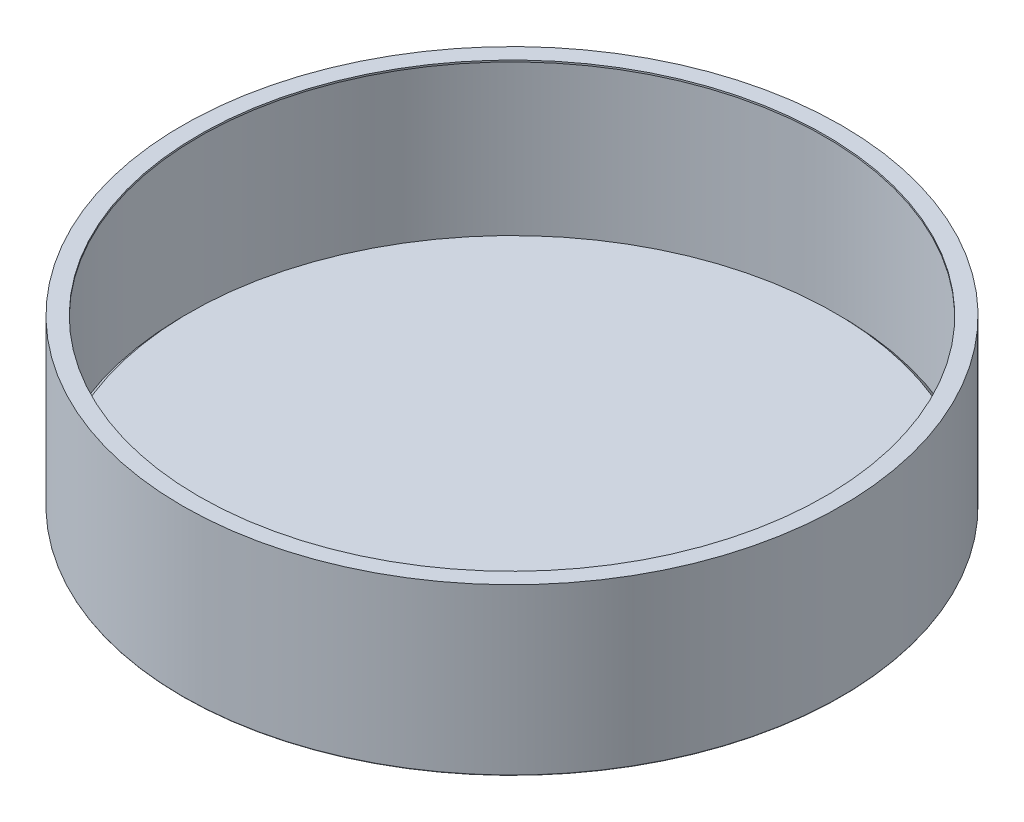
ISO-10303-21;
HEADER;
FILE_DESCRIPTION(('STEP AP214'),'2;1');
FILE_NAME('part.step','',(''),(''),'','','');
FILE_SCHEMA(('AUTOMOTIVE_DESIGN { 1 0 10303 214 1 1 1 1 }'));
ENDSEC;
DATA;
#1=APPLICATION_CONTEXT('core data for automotive mechanical design processes');
#2=APPLICATION_PROTOCOL_DEFINITION('international standard','automotive_design',2000,#1);
#3=PRODUCT_CONTEXT('',#1,'mechanical');
#4=PRODUCT('Part','Part','',(#3));
#5=PRODUCT_RELATED_PRODUCT_CATEGORY('part','',(#4));
#6=PRODUCT_DEFINITION_FORMATION('','',#4);
#7=PRODUCT_DEFINITION_CONTEXT('part definition',#1,'design');
#8=PRODUCT_DEFINITION('design','',#6,#7);
#9=PRODUCT_DEFINITION_SHAPE('','',#8);
#10=(LENGTH_UNIT() NAMED_UNIT(*) SI_UNIT(.MILLI.,.METRE.));
#11=(NAMED_UNIT(*) PLANE_ANGLE_UNIT() SI_UNIT($,.RADIAN.));
#12=(NAMED_UNIT(*) SI_UNIT($,.STERADIAN.) SOLID_ANGLE_UNIT());
#13=UNCERTAINTY_MEASURE_WITH_UNIT(LENGTH_MEASURE(1.E-05),#10,'distance_accuracy_value','');
#14=(GEOMETRIC_REPRESENTATION_CONTEXT(3) GLOBAL_UNCERTAINTY_ASSIGNED_CONTEXT((#13)) GLOBAL_UNIT_ASSIGNED_CONTEXT((#10,
#11,#12)) REPRESENTATION_CONTEXT('',''));
#15=CARTESIAN_POINT('',(0.,0.,0.));
#16=DIRECTION('',(0.,0.,1.));
#17=DIRECTION('',(1.,0.,0.));
#18=AXIS2_PLACEMENT_3D('',#15,#16,#17);
#19=CARTESIAN_POINT('',(0.,0.,0.));
#20=DIRECTION('',(0.,-1.,0.));
#21=DIRECTION('',(0.,0.,-1.));
#22=AXIS2_PLACEMENT_3D('',#19,#20,#21);
#23=PLANE('',#22);
#24=CARTESIAN_POINT('',(0.0938221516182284,0.,100.093822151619));
#25=DIRECTION('',(0.,-1.,0.));
#26=DIRECTION('',(0.,0.,-1.));
#27=AXIS2_PLACEMENT_3D('',#24,#25,#26);
#28=CIRCLE('',#27,6.00000000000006);
#29=CARTESIAN_POINT('',(0.0938221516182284,0.,94.0938221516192));
#30=VERTEX_POINT('',#29);
#31=EDGE_CURVE('E10',#30,#30,#28,.T.);
#32=ORIENTED_EDGE('',*,*,#31,.F.);
#33=EDGE_LOOP('',(#32));
#34=FACE_BOUND('',#33,.T.);
#35=CARTESIAN_POINT('',(100.187644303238,0.,0.));
#36=DIRECTION('',(0.,-1.,0.));
#37=DIRECTION('',(0.,0.,-1.));
#38=AXIS2_PLACEMENT_3D('',#35,#36,#37);
#39=CIRCLE('',#38,6.00000000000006);
#40=CARTESIAN_POINT('',(100.187644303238,0.,-6.00000000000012));
#41=VERTEX_POINT('',#40);
#42=EDGE_CURVE('E44',#41,#41,#39,.T.);
#43=ORIENTED_EDGE('',*,*,#42,.F.);
#44=EDGE_LOOP('',(#43));
#45=FACE_BOUND('',#44,.T.);
#46=CARTESIAN_POINT('',(0.0938221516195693,0.,-100.093822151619));
#47=DIRECTION('',(0.,-1.,0.));
#48=DIRECTION('',(0.,0.,-1.));
#49=AXIS2_PLACEMENT_3D('',#46,#47,#48);
#50=CIRCLE('',#49,6.00000000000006);
#51=CARTESIAN_POINT('',(0.0938221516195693,0.,-106.093822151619));
#52=VERTEX_POINT('',#51);
#53=EDGE_CURVE('E49',#52,#52,#50,.T.);
#54=ORIENTED_EDGE('',*,*,#53,.F.);
#55=EDGE_LOOP('',(#54));
#56=FACE_BOUND('',#55,.T.);
#57=CARTESIAN_POINT('',(-100.,0.,0.));
#58=DIRECTION('',(0.,-1.,0.));
#59=DIRECTION('',(0.,0.,-1.));
#60=AXIS2_PLACEMENT_3D('',#57,#58,#59);
#61=CIRCLE('',#60,6.00000000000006);
#62=CARTESIAN_POINT('',(-100.,0.,-6.00000000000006));
#63=VERTEX_POINT('',#62);
#64=EDGE_CURVE('E54',#63,#63,#61,.T.);
#65=ORIENTED_EDGE('',*,*,#64,.F.);
#66=EDGE_LOOP('',(#65));
#67=FACE_BOUND('',#66,.T.);
#68=CARTESIAN_POINT('',(0.,0.,0.));
#69=DIRECTION('',(0.,1.,0.));
#70=DIRECTION('',(0.,0.,1.));
#71=AXIS2_PLACEMENT_3D('',#68,#69,#70);
#72=CIRCLE('',#71,195.975685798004);
#73=CARTESIAN_POINT('',(0.,0.,195.975685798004));
#74=VERTEX_POINT('',#73);
#75=EDGE_CURVE('E60',#74,#74,#72,.T.);
#76=ORIENTED_EDGE('',*,*,#75,.F.);
#77=EDGE_LOOP('',(#76));
#78=FACE_BOUND('',#77,.T.);
#79=ADVANCED_FACE('F37',(#34,#45,#56,#67,#78),#23,.T.);
#80=CARTESIAN_POINT('',(0.,-2.8586098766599,0.));
#81=DIRECTION('',(0.,-1.,0.));
#82=DIRECTION('',(0.,0.,-1.));
#83=AXIS2_PLACEMENT_3D('',#80,#81,#82);
#84=CONICAL_SURFACE('',#83,198.900626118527,0.796866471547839);
#85=ORIENTED_EDGE('',*,*,#75,.T.);
#86=EDGE_LOOP('',(#85));
#87=FACE_BOUND('',#86,.T.);
#88=CARTESIAN_POINT('',(0.,-2.8586098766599,0.));
#89=DIRECTION('',(0.,1.,0.));
#90=DIRECTION('',(0.,0.,1.));
#91=AXIS2_PLACEMENT_3D('',#88,#89,#90);
#92=CIRCLE('',#91,198.900626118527);
#93=CARTESIAN_POINT('',(0.,-2.8586098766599,198.900626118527));
#94=VERTEX_POINT('',#93);
#95=EDGE_CURVE('E64',#94,#94,#92,.T.);
#96=ORIENTED_EDGE('',*,*,#95,.F.);
#97=EDGE_LOOP('',(#96));
#98=FACE_BOUND('',#97,.T.);
#99=ADVANCED_FACE('F136',(#87,#98),#84,.F.);
#100=CARTESIAN_POINT('',(0.,-2.50102516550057,0.));
#101=DIRECTION('',(0.,1.,0.));
#102=DIRECTION('',(0.,0.,1.));
#103=AXIS2_PLACEMENT_3D('',#100,#101,#102);
#104=TOROIDAL_SURFACE('',#103,199.250101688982,0.500000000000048);
#105=ORIENTED_EDGE('',*,*,#95,.T.);
#106=EDGE_LOOP('',(#105));
#107=FACE_BOUND('',#106,.T.);
#108=CARTESIAN_POINT('',(0.,-3.00102516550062,0.));
#109=DIRECTION('',(0.,1.,0.));
#110=DIRECTION('',(0.,0.,1.));
#111=AXIS2_PLACEMENT_3D('',#108,#109,#110);
#112=CIRCLE('',#111,199.250101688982);
#113=CARTESIAN_POINT('',(0.,-3.00102516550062,199.250101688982));
#114=VERTEX_POINT('',#113);
#115=EDGE_CURVE('E68',#114,#114,#112,.T.);
#116=ORIENTED_EDGE('',*,*,#115,.F.);
#117=EDGE_LOOP('',(#116));
#118=FACE_BOUND('',#117,.T.);
#119=ADVANCED_FACE('F141',(#107,#118),#104,.T.);
#120=CARTESIAN_POINT('',(-199.530777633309,-3.00102516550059,0.));
#121=DIRECTION('',(0.,-1.,0.));
#122=DIRECTION('',(0.,0.,-1.));
#123=AXIS2_PLACEMENT_3D('',#120,#121,#122);
#124=PLANE('',#123);
#125=ORIENTED_EDGE('',*,*,#115,.T.);
#126=EDGE_LOOP('',(#125));
#127=FACE_BOUND('',#126,.T.);
#128=CARTESIAN_POINT('',(0.,-3.00102516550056,0.));
#129=DIRECTION('',(0.,1.,0.));
#130=DIRECTION('',(0.,0.,1.));
#131=AXIS2_PLACEMENT_3D('',#128,#129,#130);
#132=CIRCLE('',#131,199.530777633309);
#133=CARTESIAN_POINT('',(0.,-3.00102516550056,199.530777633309));
#134=VERTEX_POINT('',#133);
#135=EDGE_CURVE('E72',#134,#134,#132,.T.);
#136=ORIENTED_EDGE('',*,*,#135,.F.);
#137=EDGE_LOOP('',(#136));
#138=FACE_BOUND('',#137,.T.);
#139=ADVANCED_FACE('F155',(#127,#138),#124,.T.);
#140=CARTESIAN_POINT('',(0.,-2.50102516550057,0.));
#141=DIRECTION('',(0.,1.,0.));
#142=DIRECTION('',(0.,0.,1.));
#143=AXIS2_PLACEMENT_3D('',#140,#141,#142);
#144=TOROIDAL_SURFACE('',#143,199.530777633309,0.5);
#145=ORIENTED_EDGE('',*,*,#135,.T.);
#146=EDGE_LOOP('',(#145));
#147=FACE_BOUND('',#146,.T.);
#148=CARTESIAN_POINT('',(0.,-2.50102516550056,0.));
#149=DIRECTION('',(0.,1.,0.));
#150=DIRECTION('',(0.,0.,1.));
#151=AXIS2_PLACEMENT_3D('',#148,#149,#150);
#152=CIRCLE('',#151,200.030777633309);
#153=CARTESIAN_POINT('',(0.,-2.50102516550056,200.030777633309));
#154=VERTEX_POINT('',#153);
#155=EDGE_CURVE('E76',#154,#154,#152,.T.);
#156=ORIENTED_EDGE('',*,*,#155,.F.);
#157=EDGE_LOOP('',(#156));
#158=FACE_BOUND('',#157,.T.);
#159=ADVANCED_FACE('F161',(#147,#158),#144,.T.);
#160=CARTESIAN_POINT('',(0.,96.1468871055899,0.));
#161=DIRECTION('',(0.,1.,0.));
#162=DIRECTION('',(0.,0.,1.));
#163=AXIS2_PLACEMENT_3D('',#160,#161,#162);
#164=CYLINDRICAL_SURFACE('',#163,200.030777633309);
#165=ORIENTED_EDGE('',*,*,#155,.T.);
#166=EDGE_LOOP('',(#165));
#167=FACE_BOUND('',#166,.T.);
#168=CARTESIAN_POINT('',(0.,97.4734323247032,0.));
#169=DIRECTION('',(0.,1.,0.));
#170=DIRECTION('',(0.,0.,1.));
#171=AXIS2_PLACEMENT_3D('',#168,#169,#170);
#172=CIRCLE('',#171,200.030777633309);
#173=CARTESIAN_POINT('',(0.,97.4734323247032,200.030777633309));
#174=VERTEX_POINT('',#173);
#175=EDGE_CURVE('E80',#174,#174,#172,.T.);
#176=ORIENTED_EDGE('',*,*,#175,.F.);
#177=EDGE_LOOP('',(#176));
#178=FACE_BOUND('',#177,.T.);
#179=ADVANCED_FACE('F167',(#167,#178),#164,.T.);
#180=CARTESIAN_POINT('',(-190.030777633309,97.4734323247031,0.));
#181=DIRECTION('',(0.,1.,0.));
#182=DIRECTION('',(0.,0.,1.));
#183=AXIS2_PLACEMENT_3D('',#180,#181,#182);
#184=PLANE('',#183);
#185=ORIENTED_EDGE('',*,*,#175,.T.);
#186=EDGE_LOOP('',(#185));
#187=FACE_BOUND('',#186,.T.);
#188=CARTESIAN_POINT('',(0.,97.473432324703,0.));
#189=DIRECTION('',(0.,1.,0.));
#190=DIRECTION('',(0.,0.,1.));
#191=AXIS2_PLACEMENT_3D('',#188,#189,#190);
#192=CIRCLE('',#191,190.030777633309);
#193=CARTESIAN_POINT('',(0.,97.473432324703,190.030777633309));
#194=VERTEX_POINT('',#193);
#195=EDGE_CURVE('E84',#194,#194,#192,.T.);
#196=ORIENTED_EDGE('',*,*,#195,.F.);
#197=EDGE_LOOP('',(#196));
#198=FACE_BOUND('',#197,.T.);
#199=ADVANCED_FACE('F173',(#187,#198),#184,.T.);
#200=CARTESIAN_POINT('',(0.,96.1468871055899,0.));
#201=DIRECTION('',(0.,1.,0.));
#202=DIRECTION('',(0.,0.,1.));
#203=AXIS2_PLACEMENT_3D('',#200,#201,#202);
#204=CYLINDRICAL_SURFACE('',#203,190.030777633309);
#205=ORIENTED_EDGE('',*,*,#195,.T.);
#206=EDGE_LOOP('',(#205));
#207=FACE_BOUND('',#206,.T.);
#208=CARTESIAN_POINT('',(0.,96.4734323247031,0.));
#209=DIRECTION('',(0.,1.,0.));
#210=DIRECTION('',(0.,0.,1.));
#211=AXIS2_PLACEMENT_3D('',#208,#209,#210);
#212=CIRCLE('',#211,190.030777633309);
#213=CARTESIAN_POINT('',(0.,96.4734323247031,190.030777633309));
#214=VERTEX_POINT('',#213);
#215=EDGE_CURVE('E88',#214,#214,#212,.T.);
#216=ORIENTED_EDGE('',*,*,#215,.F.);
#217=EDGE_LOOP('',(#216));
#218=FACE_BOUND('',#217,.T.);
#219=ADVANCED_FACE('F179',(#207,#218),#204,.F.);
#220=CARTESIAN_POINT('',(-198.986716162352,96.4734323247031,0.));
#221=DIRECTION('',(0.,-1.,0.));
#222=DIRECTION('',(0.,0.,-1.));
#223=AXIS2_PLACEMENT_3D('',#220,#221,#222);
#224=PLANE('',#223);
#225=ORIENTED_EDGE('',*,*,#215,.T.);
#226=EDGE_LOOP('',(#225));
#227=FACE_BOUND('',#226,.T.);
#228=CARTESIAN_POINT('',(0.,96.4734323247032,0.));
#229=DIRECTION('',(0.,1.,0.));
#230=DIRECTION('',(0.,0.,1.));
#231=AXIS2_PLACEMENT_3D('',#228,#229,#230);
#232=CIRCLE('',#231,198.986716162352);
#233=CARTESIAN_POINT('',(0.,96.4734323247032,198.986716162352));
#234=VERTEX_POINT('',#233);
#235=EDGE_CURVE('E92',#234,#234,#232,.T.);
#236=ORIENTED_EDGE('',*,*,#235,.F.);
#237=EDGE_LOOP('',(#236));
#238=FACE_BOUND('',#237,.T.);
#239=ADVANCED_FACE('F185',(#227,#238),#224,.T.);
#240=CARTESIAN_POINT('',(0.,96.1468871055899,0.));
#241=DIRECTION('',(0.,1.,0.));
#242=DIRECTION('',(0.,0.,1.));
#243=AXIS2_PLACEMENT_3D('',#240,#241,#242);
#244=CYLINDRICAL_SURFACE('',#243,198.986716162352);
#245=ORIENTED_EDGE('',*,*,#235,.T.);
#246=EDGE_LOOP('',(#245));
#247=FACE_BOUND('',#246,.T.);
#248=CARTESIAN_POINT('',(0.,-2.01882482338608,0.));
#249=DIRECTION('',(0.,1.,0.));
#250=DIRECTION('',(0.,0.,1.));
#251=AXIS2_PLACEMENT_3D('',#248,#249,#250);
#252=CIRCLE('',#251,198.986716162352);
#253=CARTESIAN_POINT('',(0.,-2.01882482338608,198.986716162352));
#254=VERTEX_POINT('',#253);
#255=EDGE_CURVE('E96',#254,#254,#252,.T.);
#256=ORIENTED_EDGE('',*,*,#255,.F.);
#257=EDGE_LOOP('',(#256));
#258=FACE_BOUND('',#257,.T.);
#259=ADVANCED_FACE('F191',(#247,#258),#244,.F.);
#260=CARTESIAN_POINT('',(0.,1.00000000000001,0.));
#261=DIRECTION('',(0.,-1.,0.));
#262=DIRECTION('',(0.,0.,-1.));
#263=AXIS2_PLACEMENT_3D('',#260,#261,#262);
#264=CONICAL_SURFACE('',#263,195.975685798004,0.784105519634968);
#265=ORIENTED_EDGE('',*,*,#255,.T.);
#266=EDGE_LOOP('',(#265));
#267=FACE_BOUND('',#266,.T.);
#268=CARTESIAN_POINT('',(0.,1.00000000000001,0.));
#269=DIRECTION('',(0.,1.,0.));
#270=DIRECTION('',(0.,0.,1.));
#271=AXIS2_PLACEMENT_3D('',#268,#269,#270);
#272=CIRCLE('',#271,195.975685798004);
#273=CARTESIAN_POINT('',(0.,1.00000000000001,195.975685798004));
#274=VERTEX_POINT('',#273);
#275=EDGE_CURVE('E100',#274,#274,#272,.T.);
#276=ORIENTED_EDGE('',*,*,#275,.F.);
#277=EDGE_LOOP('',(#276));
#278=FACE_BOUND('',#277,.T.);
#279=ADVANCED_FACE('F197',(#267,#278),#264,.T.);
#280=CARTESIAN_POINT('',(-195.975685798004,1.00000000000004,0.));
#281=DIRECTION('',(0.,1.,0.));
#282=DIRECTION('',(0.,0.,1.));
#283=AXIS2_PLACEMENT_3D('',#280,#281,#282);
#284=PLANE('',#283);
#285=ORIENTED_EDGE('',*,*,#275,.T.);
#286=EDGE_LOOP('',(#285));
#287=FACE_BOUND('',#286,.T.);
#288=ADVANCED_FACE('F203',(#287),#284,.T.);
#289=CARTESIAN_POINT('',(-100.,-2.,0.));
#290=DIRECTION('',(0.,-1.,0.));
#291=DIRECTION('',(0.,0.,-1.));
#292=AXIS2_PLACEMENT_3D('',#289,#290,#291);
#293=PLANE('',#292);
#294=CARTESIAN_POINT('',(-100.,-2.,0.));
#295=DIRECTION('',(0.,1.,0.));
#296=DIRECTION('',(0.,0.,1.));
#297=AXIS2_PLACEMENT_3D('',#294,#295,#296);
#298=CIRCLE('',#297,3.);
#299=CARTESIAN_POINT('',(-100.,-2.,3.));
#300=VERTEX_POINT('',#299);
#301=EDGE_CURVE('E104',#300,#300,#298,.T.);
#302=ORIENTED_EDGE('',*,*,#301,.F.);
#303=EDGE_LOOP('',(#302));
#304=FACE_BOUND('',#303,.T.);
#305=ADVANCED_FACE('F208',(#304),#293,.T.);
#306=CARTESIAN_POINT('',(-100.,0.,0.));
#307=DIRECTION('',(0.,1.,0.));
#308=DIRECTION('',(0.,0.,1.));
#309=AXIS2_PLACEMENT_3D('',#306,#307,#308);
#310=CONICAL_SURFACE('',#309,6.00000000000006,0.982793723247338);
#311=ORIENTED_EDGE('',*,*,#301,.T.);
#312=EDGE_LOOP('',(#311));
#313=FACE_BOUND('',#312,.T.);
#314=ORIENTED_EDGE('',*,*,#64,.T.);
#315=EDGE_LOOP('',(#314));
#316=FACE_BOUND('',#315,.T.);
#317=ADVANCED_FACE('F213',(#313,#316),#310,.T.);
#318=CARTESIAN_POINT('',(0.0938221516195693,-2.,-100.093822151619));
#319=DIRECTION('',(0.,-1.,0.));
#320=DIRECTION('',(1.,0.,0.));
#321=AXIS2_PLACEMENT_3D('',#318,#319,#320);
#322=PLANE('',#321);
#323=CARTESIAN_POINT('',(0.0938221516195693,-2.,-100.093822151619));
#324=DIRECTION('',(0.,1.,0.));
#325=DIRECTION('',(-1.,0.,0.));
#326=AXIS2_PLACEMENT_3D('',#323,#324,#325);
#327=CIRCLE('',#326,3.);
#328=CARTESIAN_POINT('',(-2.90617784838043,-2.,-100.093822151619));
#329=VERTEX_POINT('',#328);
#330=EDGE_CURVE('E108',#329,#329,#327,.T.);
#331=ORIENTED_EDGE('',*,*,#330,.F.);
#332=EDGE_LOOP('',(#331));
#333=FACE_BOUND('',#332,.T.);
#334=ADVANCED_FACE('F219',(#333),#322,.T.);
#335=CARTESIAN_POINT('',(0.0938221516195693,0.,-100.093822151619));
#336=DIRECTION('',(0.,1.,0.));
#337=DIRECTION('',(-1.,0.,0.));
#338=AXIS2_PLACEMENT_3D('',#335,#336,#337);
#339=CONICAL_SURFACE('',#338,6.00000000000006,0.982793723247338);
#340=ORIENTED_EDGE('',*,*,#330,.T.);
#341=EDGE_LOOP('',(#340));
#342=FACE_BOUND('',#341,.T.);
#343=ORIENTED_EDGE('',*,*,#53,.T.);
#344=EDGE_LOOP('',(#343));
#345=FACE_BOUND('',#344,.T.);
#346=ADVANCED_FACE('F223',(#342,#345),#339,.T.);
#347=CARTESIAN_POINT('',(100.187644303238,-2.,0.));
#348=DIRECTION('',(0.,-1.,0.));
#349=DIRECTION('',(0.,0.,1.));
#350=AXIS2_PLACEMENT_3D('',#347,#348,#349);
#351=PLANE('',#350);
#352=CARTESIAN_POINT('',(100.187644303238,-2.,0.));
#353=DIRECTION('',(0.,1.,0.));
#354=DIRECTION('',(0.,0.,-1.));
#355=AXIS2_PLACEMENT_3D('',#352,#353,#354);
#356=CIRCLE('',#355,3.);
#357=CARTESIAN_POINT('',(100.187644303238,-2.,-3.00000000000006));
#358=VERTEX_POINT('',#357);
#359=EDGE_CURVE('E112',#358,#358,#356,.T.);
#360=ORIENTED_EDGE('',*,*,#359,.F.);
#361=EDGE_LOOP('',(#360));
#362=FACE_BOUND('',#361,.T.);
#363=ADVANCED_FACE('F132',(#362),#351,.T.);
#364=CARTESIAN_POINT('',(100.187644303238,0.,0.));
#365=DIRECTION('',(0.,1.,0.));
#366=DIRECTION('',(0.,0.,-1.));
#367=AXIS2_PLACEMENT_3D('',#364,#365,#366);
#368=CONICAL_SURFACE('',#367,6.00000000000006,0.982793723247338);
#369=ORIENTED_EDGE('',*,*,#359,.T.);
#370=EDGE_LOOP('',(#369));
#371=FACE_BOUND('',#370,.T.);
#372=ORIENTED_EDGE('',*,*,#42,.T.);
#373=EDGE_LOOP('',(#372));
#374=FACE_BOUND('',#373,.T.);
#375=ADVANCED_FACE('F125',(#371,#374),#368,.T.);
#376=CARTESIAN_POINT('',(0.0938221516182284,-2.,100.093822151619));
#377=DIRECTION('',(0.,-1.,0.));
#378=DIRECTION('',(-1.,0.,0.));
#379=AXIS2_PLACEMENT_3D('',#376,#377,#378);
#380=PLANE('',#379);
#381=CARTESIAN_POINT('',(0.0938221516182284,-2.,100.093822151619));
#382=DIRECTION('',(0.,1.,0.));
#383=DIRECTION('',(1.,0.,0.));
#384=AXIS2_PLACEMENT_3D('',#381,#382,#383);
#385=CIRCLE('',#384,3.);
#386=CARTESIAN_POINT('',(3.09382215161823,-2.,100.093822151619));
#387=VERTEX_POINT('',#386);
#388=EDGE_CURVE('E116',#387,#387,#385,.T.);
#389=ORIENTED_EDGE('',*,*,#388,.F.);
#390=EDGE_LOOP('',(#389));
#391=FACE_BOUND('',#390,.T.);
#392=ADVANCED_FACE('F123',(#391),#380,.T.);
#393=CARTESIAN_POINT('',(0.0938221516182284,0.,100.093822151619));
#394=DIRECTION('',(0.,1.,0.));
#395=DIRECTION('',(1.,0.,0.));
#396=AXIS2_PLACEMENT_3D('',#393,#394,#395);
#397=CONICAL_SURFACE('',#396,6.00000000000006,0.982793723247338);
#398=ORIENTED_EDGE('',*,*,#388,.T.);
#399=EDGE_LOOP('',(#398));
#400=FACE_BOUND('',#399,.T.);
#401=ORIENTED_EDGE('',*,*,#31,.T.);
#402=EDGE_LOOP('',(#401));
#403=FACE_BOUND('',#402,.T.);
#404=ADVANCED_FACE('F121',(#400,#403),#397,.T.);
#405=CLOSED_SHELL('',(#79,#99,#119,#139,#159,#179,#199,#219,#239,#259,#279,#288,#305,#317,#334,
#346,#363,#375,#392,#404));
#406=MANIFOLD_SOLID_BREP('B2',#405);
#407=ADVANCED_BREP_SHAPE_REPRESENTATION('',(#18,#406),#14);
#408=SHAPE_DEFINITION_REPRESENTATION(#9,#407);
ENDSEC;
END-ISO-10303-21;
